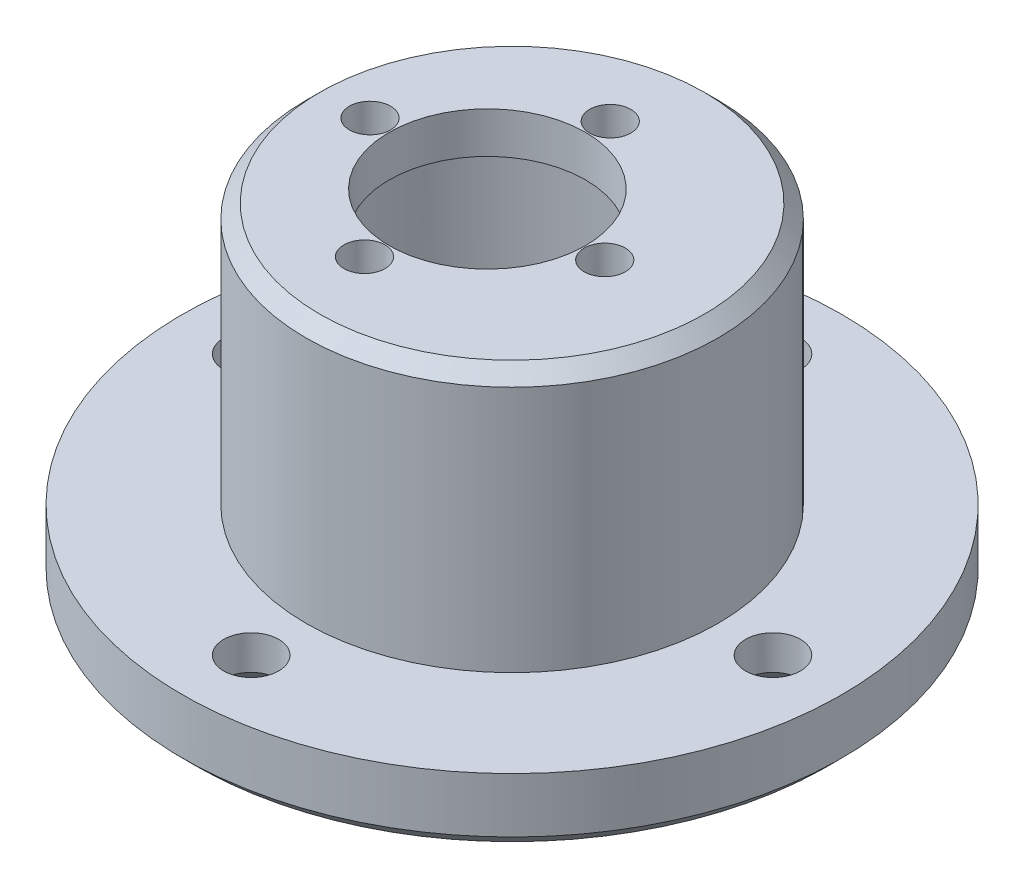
ISO-10303-21;
HEADER;
FILE_DESCRIPTION(('STEP AP214'),'2;1');
FILE_NAME('part.step','',(''),(''),'','','');
FILE_SCHEMA(('AUTOMOTIVE_DESIGN { 1 0 10303 214 1 1 1 1 }'));
ENDSEC;
DATA;
#1=APPLICATION_CONTEXT('core data for automotive mechanical design processes');
#2=APPLICATION_PROTOCOL_DEFINITION('international standard','automotive_design',2000,#1);
#3=PRODUCT_CONTEXT('',#1,'mechanical');
#4=PRODUCT('Part','Part','',(#3));
#5=PRODUCT_RELATED_PRODUCT_CATEGORY('part','',(#4));
#6=PRODUCT_DEFINITION_FORMATION('','',#4);
#7=PRODUCT_DEFINITION_CONTEXT('part definition',#1,'design');
#8=PRODUCT_DEFINITION('design','',#6,#7);
#9=PRODUCT_DEFINITION_SHAPE('','',#8);
#10=(LENGTH_UNIT() NAMED_UNIT(*) SI_UNIT(.MILLI.,.METRE.));
#11=(NAMED_UNIT(*) PLANE_ANGLE_UNIT() SI_UNIT($,.RADIAN.));
#12=(NAMED_UNIT(*) SI_UNIT($,.STERADIAN.) SOLID_ANGLE_UNIT());
#13=UNCERTAINTY_MEASURE_WITH_UNIT(LENGTH_MEASURE(1.E-05),#10,'distance_accuracy_value','');
#14=(GEOMETRIC_REPRESENTATION_CONTEXT(3) GLOBAL_UNCERTAINTY_ASSIGNED_CONTEXT((#13)) GLOBAL_UNIT_ASSIGNED_CONTEXT((#10,
#11,#12)) REPRESENTATION_CONTEXT('',''));
#15=CARTESIAN_POINT('',(0.,0.,0.));
#16=DIRECTION('',(0.,0.,1.));
#17=DIRECTION('',(1.,0.,0.));
#18=AXIS2_PLACEMENT_3D('',#15,#16,#17);
#19=CARTESIAN_POINT('',(0.,-5.,0.));
#20=DIRECTION('',(0.,-1.,0.));
#21=DIRECTION('',(0.,0.,-1.));
#22=AXIS2_PLACEMENT_3D('',#19,#20,#21);
#23=PLANE('',#22);
#24=CARTESIAN_POINT('',(-1.8,-5.,0.));
#25=DIRECTION('',(0.,-1.,0.));
#26=DIRECTION('',(0.,0.,-1.));
#27=AXIS2_PLACEMENT_3D('',#24,#25,#26);
#28=CIRCLE('',#27,12.75);
#29=CARTESIAN_POINT('',(-14.5369912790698,-5.,-0.575806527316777));
#30=VERTEX_POINT('',#29);
#31=CARTESIAN_POINT('',(-14.5369912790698,-5.,0.575806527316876));
#32=VERTEX_POINT('',#31);
#33=EDGE_CURVE('E47',#30,#32,#28,.T.);
#34=ORIENTED_EDGE('',*,*,#33,.F.);
#35=CARTESIAN_POINT('',(-19.,-5.,0.));
#36=DIRECTION('',(0.,-1.,0.));
#37=DIRECTION('',(-1.,0.,0.));
#38=AXIS2_PLACEMENT_3D('',#35,#36,#37);
#39=CIRCLE('',#38,4.5);
#40=CARTESIAN_POINT('',(-22.8881578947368,-5.,-2.26544216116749));
#41=VERTEX_POINT('',#40);
#42=EDGE_CURVE('E84',#30,#41,#39,.F.);
#43=ORIENTED_EDGE('',*,*,#42,.T.);
#44=CARTESIAN_POINT('',(0.,-5.,0.));
#45=DIRECTION('',(0.,-1.,0.));
#46=DIRECTION('',(0.,0.,-1.));
#47=AXIS2_PLACEMENT_3D('',#44,#45,#46);
#48=CIRCLE('',#47,23.);
#49=CARTESIAN_POINT('',(-2.26544216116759,-5.,-22.8881578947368));
#50=VERTEX_POINT('',#49);
#51=EDGE_CURVE('E119',#41,#50,#48,.T.);
#52=ORIENTED_EDGE('',*,*,#51,.T.);
#53=CARTESIAN_POINT('',(0.,-5.,-19.));
#54=DIRECTION('',(0.,-1.,0.));
#55=DIRECTION('',(0.,0.,-1.));
#56=AXIS2_PLACEMENT_3D('',#53,#54,#55);
#57=CIRCLE('',#56,4.5);
#58=CARTESIAN_POINT('',(2.26544216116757,-5.,-22.8881578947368));
#59=VERTEX_POINT('',#58);
#60=EDGE_CURVE('E130',#50,#59,#57,.F.);
#61=ORIENTED_EDGE('',*,*,#60,.T.);
#62=CARTESIAN_POINT('',(22.8881578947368,-5.,-2.26544216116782));
#63=VERTEX_POINT('',#62);
#64=EDGE_CURVE('E120',#59,#63,#48,.T.);
#65=ORIENTED_EDGE('',*,*,#64,.T.);
#66=CARTESIAN_POINT('',(19.,-5.,-1.99014436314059E-13));
#67=DIRECTION('',(0.,-1.,0.));
#68=DIRECTION('',(1.,0.,0.));
#69=AXIS2_PLACEMENT_3D('',#66,#67,#68);
#70=CIRCLE('',#69,4.5);
#71=CARTESIAN_POINT('',(22.8881578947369,-5.,2.26544216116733));
#72=VERTEX_POINT('',#71);
#73=EDGE_CURVE('E54',#63,#72,#70,.F.);
#74=ORIENTED_EDGE('',*,*,#73,.T.);
#75=CARTESIAN_POINT('',(2.26544216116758,-5.,22.8881578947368));
#76=VERTEX_POINT('',#75);
#77=EDGE_CURVE('E124',#72,#76,#48,.T.);
#78=ORIENTED_EDGE('',*,*,#77,.T.);
#79=CARTESIAN_POINT('',(0.,-5.,19.));
#80=DIRECTION('',(0.,-1.,0.));
#81=DIRECTION('',(0.,0.,1.));
#82=AXIS2_PLACEMENT_3D('',#79,#80,#81);
#83=CIRCLE('',#82,4.5);
#84=CARTESIAN_POINT('',(-2.26544216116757,-5.,22.8881578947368));
#85=VERTEX_POINT('',#84);
#86=EDGE_CURVE('E471',#76,#85,#83,.F.);
#87=ORIENTED_EDGE('',*,*,#86,.T.);
#88=CARTESIAN_POINT('',(-22.8881578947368,-5.,2.26544216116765));
#89=VERTEX_POINT('',#88);
#90=EDGE_CURVE('E476',#85,#89,#48,.T.);
#91=ORIENTED_EDGE('',*,*,#90,.T.);
#92=EDGE_CURVE('E86',#89,#32,#39,.F.);
#93=ORIENTED_EDGE('',*,*,#92,.T.);
#94=EDGE_LOOP('',(#34,#43,#52,#61,#65,#74,#78,#87,#91,#93));
#95=FACE_BOUND('',#94,.T.);
#96=ADVANCED_FACE('F31',(#95),#23,.T.);
#97=CARTESIAN_POINT('',(0.,-5.,0.));
#98=DIRECTION('',(0.,1.,0.));
#99=DIRECTION('',(0.,0.,1.));
#100=AXIS2_PLACEMENT_3D('',#97,#98,#99);
#101=CONICAL_SURFACE('',#100,23.,0.78539816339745);
#102=CARTESIAN_POINT('',(0.,-4.,0.));
#103=DIRECTION('',(0.,-1.,0.));
#104=DIRECTION('',(0.,0.,-1.));
#105=AXIS2_PLACEMENT_3D('',#102,#103,#104);
#106=CIRCLE('',#105,24.);
#107=CARTESIAN_POINT('',(0.,-4.,-24.));
#108=VERTEX_POINT('',#107);
#109=EDGE_CURVE('E123',#108,#108,#106,.F.);
#110=ORIENTED_EDGE('',*,*,#109,.F.);
#111=EDGE_LOOP('',(#110));
#112=FACE_BOUND('',#111,.T.);
#113=ORIENTED_EDGE('',*,*,#77,.F.);
#114=CARTESIAN_POINT('',(22.8881578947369,-5.,2.26544216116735));
#115=CARTESIAN_POINT('',(22.942196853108,-4.96266399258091,2.09865584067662));
#116=CARTESIAN_POINT('',(22.9907389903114,-4.92912578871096,1.9291749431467));
#117=CARTESIAN_POINT('',(23.0760448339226,-4.87018720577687,1.58577992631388));
#118=CARTESIAN_POINT('',(23.1128009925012,-4.84479204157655,1.41186304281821));
#119=CARTESIAN_POINT('',(23.1736453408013,-4.80275412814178,1.06096163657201));
#120=CARTESIAN_POINT('',(23.1977474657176,-4.78610175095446,0.883980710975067));
#121=CARTESIAN_POINT('',(23.2327932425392,-4.76188830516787,0.528151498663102));
#122=CARTESIAN_POINT('',(23.2437409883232,-4.75432440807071,0.349303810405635));
#123=CARTESIAN_POINT('',(23.2521348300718,-4.74852502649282,-0.0049821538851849));
#124=CARTESIAN_POINT('',(23.2498680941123,-4.75009113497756,-0.180410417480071));
#125=CARTESIAN_POINT('',(23.2325528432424,-4.76205439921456,-0.530333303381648));
#126=CARTESIAN_POINT('',(23.2175041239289,-4.77245169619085,-0.704827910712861));
#127=CARTESIAN_POINT('',(23.1750103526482,-4.80181102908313,-1.05121369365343));
#128=CARTESIAN_POINT('',(23.1475890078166,-4.82075668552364,-1.22310920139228));
#129=CARTESIAN_POINT('',(23.0809530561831,-4.8667960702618,-1.56340625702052));
#130=CARTESIAN_POINT('',(23.0417444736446,-4.89388563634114,-1.73180954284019));
#131=CARTESIAN_POINT('',(22.9803794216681,-4.93628330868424,-1.95989206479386));
#132=CARTESIAN_POINT('',(22.9629557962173,-4.94832144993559,-2.0215036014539));
#133=CARTESIAN_POINT('',(22.9266460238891,-4.97340820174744,-2.14400274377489));
#134=CARTESIAN_POINT('',(22.9077616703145,-4.9864555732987,-2.20489113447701));
#135=CARTESIAN_POINT('',(22.8881578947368,-5.,-2.26544216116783));
#136=B_SPLINE_CURVE_WITH_KNOTS('',3,(#114,#115,#116,#117,#118,#119,#120,#121,#122,#123,#124,
#125,#126,#127,#128,#129,#130,#131,#132,#133,#134,#135),.UNSPECIFIED.,.F.,.F.,(4,2,2,2,2,2,2,2,
2,2,4),(0.,0.53770654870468,1.07575676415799,1.61321320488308,2.1505023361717,2.67615961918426,
3.20182530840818,3.72648802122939,4.25088304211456,4.446311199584,4.64150313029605),.UNSPECIFIED.);
#137=EDGE_CURVE('E212',#72,#63,#136,.T.);
#138=ORIENTED_EDGE('',*,*,#137,.T.);
#139=ORIENTED_EDGE('',*,*,#64,.F.);
#140=CARTESIAN_POINT('',(2.26544216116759,-5.,-22.8881578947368));
#141=CARTESIAN_POINT('',(2.09865584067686,-4.96266399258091,-22.942196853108));
#142=CARTESIAN_POINT('',(1.92917494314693,-4.92912578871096,-22.9907389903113));
#143=CARTESIAN_POINT('',(1.58577992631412,-4.87018720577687,-23.0760448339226));
#144=CARTESIAN_POINT('',(1.41186304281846,-4.84479204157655,-23.1128009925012));
#145=CARTESIAN_POINT('',(1.06096163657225,-4.80275412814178,-23.1736453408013));
#146=CARTESIAN_POINT('',(0.88398071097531,-4.78610175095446,-23.1977474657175));
#147=CARTESIAN_POINT('',(0.528151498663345,-4.76188830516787,-23.2327932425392));
#148=CARTESIAN_POINT('',(0.349303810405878,-4.7543244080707,-23.2437409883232));
#149=CARTESIAN_POINT('',(-0.00498215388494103,-4.74852502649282,-23.2521348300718));
#150=CARTESIAN_POINT('',(-0.180410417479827,-4.75009113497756,-23.2498680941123));
#151=CARTESIAN_POINT('',(-0.530333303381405,-4.76205439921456,-23.2325528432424));
#152=CARTESIAN_POINT('',(-0.704827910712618,-4.77245169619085,-23.2175041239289));
#153=CARTESIAN_POINT('',(-1.05121369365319,-4.80181102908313,-23.1750103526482));
#154=CARTESIAN_POINT('',(-1.22310920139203,-4.82075668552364,-23.1475890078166));
#155=CARTESIAN_POINT('',(-1.56340625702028,-4.8667960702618,-23.0809530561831));
#156=CARTESIAN_POINT('',(-1.73180954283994,-4.89388563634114,-23.0417444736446));
#157=CARTESIAN_POINT('',(-1.95989206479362,-4.93628330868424,-22.9803794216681));
#158=CARTESIAN_POINT('',(-2.02150360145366,-4.94832144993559,-22.9629557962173));
#159=CARTESIAN_POINT('',(-2.14400274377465,-4.97340820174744,-22.9266460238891));
#160=CARTESIAN_POINT('',(-2.20489113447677,-4.9864555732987,-22.9077616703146));
#161=CARTESIAN_POINT('',(-2.26544216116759,-5.,-22.8881578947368));
#162=B_SPLINE_CURVE_WITH_KNOTS('',3,(#140,#141,#142,#143,#144,#145,#146,#147,#148,#149,#150,
#151,#152,#153,#154,#155,#156,#157,#158,#159,#160,#161),.UNSPECIFIED.,.F.,.F.,(4,2,2,2,2,2,2,2,
2,2,4),(0.,0.537706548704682,1.07575676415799,1.61321320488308,2.1505023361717,2.67615961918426,
3.20182530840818,3.72648802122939,4.25088304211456,4.446311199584,4.64150313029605),.UNSPECIFIED.);
#163=EDGE_CURVE('E41',#59,#50,#162,.T.);
#164=ORIENTED_EDGE('',*,*,#163,.T.);
#165=ORIENTED_EDGE('',*,*,#51,.F.);
#166=CARTESIAN_POINT('',(-22.8881578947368,-5.,-2.26544216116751));
#167=CARTESIAN_POINT('',(-22.942196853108,-4.96266399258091,-2.09865584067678));
#168=CARTESIAN_POINT('',(-22.9907389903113,-4.92912578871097,-1.92917494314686));
#169=CARTESIAN_POINT('',(-23.0760448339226,-4.87018720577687,-1.58577992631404));
#170=CARTESIAN_POINT('',(-23.1128009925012,-4.84479204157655,-1.41186304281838));
#171=CARTESIAN_POINT('',(-23.1736453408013,-4.80275412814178,-1.06096163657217));
#172=CARTESIAN_POINT('',(-23.1977474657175,-4.78610175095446,-0.883980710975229));
#173=CARTESIAN_POINT('',(-23.2327932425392,-4.76188830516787,-0.528151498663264));
#174=CARTESIAN_POINT('',(-23.2437409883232,-4.75432440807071,-0.349303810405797));
#175=CARTESIAN_POINT('',(-23.2521348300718,-4.74852502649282,0.00498215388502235));
#176=CARTESIAN_POINT('',(-23.2498680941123,-4.75009113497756,0.180410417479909));
#177=CARTESIAN_POINT('',(-23.2325528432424,-4.76205439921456,0.530333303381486));
#178=CARTESIAN_POINT('',(-23.2175041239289,-4.77245169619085,0.704827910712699));
#179=CARTESIAN_POINT('',(-23.1750103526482,-4.80181102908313,1.05121369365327));
#180=CARTESIAN_POINT('',(-23.1475890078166,-4.82075668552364,1.22310920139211));
#181=CARTESIAN_POINT('',(-23.0809530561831,-4.8667960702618,1.56340625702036));
#182=CARTESIAN_POINT('',(-23.0417444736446,-4.89388563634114,1.73180954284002));
#183=CARTESIAN_POINT('',(-22.9803794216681,-4.93628330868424,1.9598920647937));
#184=CARTESIAN_POINT('',(-22.9629557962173,-4.94832144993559,2.02150360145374));
#185=CARTESIAN_POINT('',(-22.9266460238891,-4.97340820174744,2.14400274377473));
#186=CARTESIAN_POINT('',(-22.9077616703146,-4.9864555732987,2.20489113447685));
#187=CARTESIAN_POINT('',(-22.8881578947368,-5.,2.26544216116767));
#188=B_SPLINE_CURVE_WITH_KNOTS('',3,(#166,#167,#168,#169,#170,#171,#172,#173,#174,#175,#176,
#177,#178,#179,#180,#181,#182,#183,#184,#185,#186,#187),.UNSPECIFIED.,.F.,.F.,(4,2,2,2,2,2,2,2,
2,2,4),(0.,0.537706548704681,1.07575676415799,1.61321320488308,2.1505023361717,2.67615961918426,
3.20182530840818,3.72648802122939,4.25088304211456,4.446311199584,4.64150313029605),.UNSPECIFIED.);
#189=EDGE_CURVE('E93',#41,#89,#188,.T.);
#190=ORIENTED_EDGE('',*,*,#189,.T.);
#191=ORIENTED_EDGE('',*,*,#90,.F.);
#192=CARTESIAN_POINT('',(-2.26544216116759,-5.,22.8881578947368));
#193=CARTESIAN_POINT('',(-2.09865584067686,-4.96266399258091,22.942196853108));
#194=CARTESIAN_POINT('',(-1.92917494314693,-4.92912578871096,22.9907389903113));
#195=CARTESIAN_POINT('',(-1.58577992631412,-4.87018720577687,23.0760448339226));
#196=CARTESIAN_POINT('',(-1.41186304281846,-4.84479204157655,23.1128009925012));
#197=CARTESIAN_POINT('',(-1.06096163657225,-4.80275412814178,23.1736453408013));
#198=CARTESIAN_POINT('',(-0.88398071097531,-4.78610175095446,23.1977474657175));
#199=CARTESIAN_POINT('',(-0.528151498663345,-4.76188830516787,23.2327932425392));
#200=CARTESIAN_POINT('',(-0.349303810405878,-4.7543244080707,23.2437409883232));
#201=CARTESIAN_POINT('',(0.00498215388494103,-4.74852502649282,23.2521348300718));
#202=CARTESIAN_POINT('',(0.180410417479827,-4.75009113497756,23.2498680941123));
#203=CARTESIAN_POINT('',(0.530333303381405,-4.76205439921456,23.2325528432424));
#204=CARTESIAN_POINT('',(0.704827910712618,-4.77245169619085,23.2175041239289));
#205=CARTESIAN_POINT('',(1.05121369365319,-4.80181102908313,23.1750103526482));
#206=CARTESIAN_POINT('',(1.22310920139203,-4.82075668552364,23.1475890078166));
#207=CARTESIAN_POINT('',(1.56340625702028,-4.8667960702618,23.0809530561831));
#208=CARTESIAN_POINT('',(1.73180954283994,-4.89388563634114,23.0417444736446));
#209=CARTESIAN_POINT('',(1.95989206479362,-4.93628330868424,22.9803794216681));
#210=CARTESIAN_POINT('',(2.02150360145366,-4.94832144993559,22.9629557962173));
#211=CARTESIAN_POINT('',(2.14400274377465,-4.97340820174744,22.9266460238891));
#212=CARTESIAN_POINT('',(2.20489113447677,-4.9864555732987,22.9077616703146));
#213=CARTESIAN_POINT('',(2.26544216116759,-5.,22.8881578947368));
#214=B_SPLINE_CURVE_WITH_KNOTS('',3,(#192,#193,#194,#195,#196,#197,#198,#199,#200,#201,#202,
#203,#204,#205,#206,#207,#208,#209,#210,#211,#212,#213),.UNSPECIFIED.,.F.,.F.,(4,2,2,2,2,2,2,2,
2,2,4),(0.,0.537706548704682,1.07575676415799,1.61321320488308,2.1505023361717,2.67615961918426,
3.20182530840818,3.72648802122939,4.25088304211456,4.446311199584,4.64150313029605),.UNSPECIFIED.);
#215=EDGE_CURVE('E192',#85,#76,#214,.T.);
#216=ORIENTED_EDGE('',*,*,#215,.T.);
#217=EDGE_LOOP('',(#113,#138,#139,#164,#165,#190,#191,#216));
#218=FACE_BOUND('',#217,.T.);
#219=ADVANCED_FACE('F143',(#112,#218),#101,.T.);
#220=CARTESIAN_POINT('',(0.,19.,0.));
#221=DIRECTION('',(0.,-1.,0.));
#222=DIRECTION('',(0.,0.,-1.));
#223=AXIS2_PLACEMENT_3D('',#220,#221,#222);
#224=CYLINDRICAL_SURFACE('',#223,15.);
#225=CARTESIAN_POINT('',(0.,18.,0.));
#226=DIRECTION('',(0.,1.,0.));
#227=DIRECTION('',(0.,0.,1.));
#228=AXIS2_PLACEMENT_3D('',#225,#226,#227);
#229=CIRCLE('',#228,15.);
#230=CARTESIAN_POINT('',(0.,18.,15.));
#231=VERTEX_POINT('',#230);
#232=EDGE_CURVE('E116',#231,#231,#229,.F.);
#233=ORIENTED_EDGE('',*,*,#232,.T.);
#234=EDGE_LOOP('',(#233));
#235=FACE_BOUND('',#234,.T.);
#236=CARTESIAN_POINT('',(0.,0.,0.));
#237=DIRECTION('',(0.,-1.,0.));
#238=DIRECTION('',(0.,0.,-1.));
#239=AXIS2_PLACEMENT_3D('',#236,#237,#238);
#240=CIRCLE('',#239,15.);
#241=CARTESIAN_POINT('',(0.,0.,-15.));
#242=VERTEX_POINT('',#241);
#243=EDGE_CURVE('E110',#242,#242,#240,.T.);
#244=ORIENTED_EDGE('',*,*,#243,.F.);
#245=EDGE_LOOP('',(#244));
#246=FACE_BOUND('',#245,.T.);
#247=ADVANCED_FACE('F147',(#235,#246),#224,.T.);
#248=CARTESIAN_POINT('',(0.,19.,0.));
#249=DIRECTION('',(0.,1.,0.));
#250=DIRECTION('',(0.,0.,1.));
#251=AXIS2_PLACEMENT_3D('',#248,#249,#250);
#252=PLANE('',#251);
#253=CARTESIAN_POINT('',(6.94771518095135,19.,0.199947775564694));
#254=DIRECTION('',(0.,1.,0.));
#255=DIRECTION('',(1.,0.,0.));
#256=AXIS2_PLACEMENT_3D('',#253,#254,#255);
#257=CIRCLE('',#256,1.5);
#258=CARTESIAN_POINT('',(8.44771518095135,19.,0.19994777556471));
#259=VERTEX_POINT('',#258);
#260=EDGE_CURVE('E255',#259,#259,#257,.T.);
#261=ORIENTED_EDGE('',*,*,#260,.F.);
#262=EDGE_LOOP('',(#261));
#263=FACE_BOUND('',#262,.T.);
#264=CARTESIAN_POINT('',(-1.6000522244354,19.,-8.74771518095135));
#265=DIRECTION('',(0.,1.,0.));
#266=DIRECTION('',(0.,0.,-1.));
#267=AXIS2_PLACEMENT_3D('',#264,#265,#266);
#268=CIRCLE('',#267,1.5);
#269=CARTESIAN_POINT('',(-1.6000522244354,19.,-10.2477151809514));
#270=VERTEX_POINT('',#269);
#271=EDGE_CURVE('E257',#270,#270,#268,.T.);
#272=ORIENTED_EDGE('',*,*,#271,.F.);
#273=EDGE_LOOP('',(#272));
#274=FACE_BOUND('',#273,.T.);
#275=CARTESIAN_POINT('',(-10.5477151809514,19.,-0.199947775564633));
#276=DIRECTION('',(0.,1.,0.));
#277=DIRECTION('',(-1.,0.,0.));
#278=AXIS2_PLACEMENT_3D('',#275,#276,#277);
#279=CIRCLE('',#278,1.5);
#280=CARTESIAN_POINT('',(-12.0477151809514,19.,-0.199947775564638));
#281=VERTEX_POINT('',#280);
#282=EDGE_CURVE('E262',#281,#281,#279,.T.);
#283=ORIENTED_EDGE('',*,*,#282,.F.);
#284=EDGE_LOOP('',(#283));
#285=FACE_BOUND('',#284,.T.);
#286=CARTESIAN_POINT('',(-1.9999477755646,19.,8.74771518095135));
#287=DIRECTION('',(0.,1.,0.));
#288=DIRECTION('',(0.,0.,1.));
#289=AXIS2_PLACEMENT_3D('',#286,#287,#288);
#290=CIRCLE('',#289,1.5);
#291=CARTESIAN_POINT('',(-1.9999477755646,19.,10.2477151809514));
#292=VERTEX_POINT('',#291);
#293=EDGE_CURVE('E266',#292,#292,#290,.T.);
#294=ORIENTED_EDGE('',*,*,#293,.F.);
#295=EDGE_LOOP('',(#294));
#296=FACE_BOUND('',#295,.T.);
#297=CARTESIAN_POINT('',(-1.8,19.,0.));
#298=DIRECTION('',(0.,-1.,0.));
#299=DIRECTION('',(0.,0.,-1.));
#300=AXIS2_PLACEMENT_3D('',#297,#298,#299);
#301=CIRCLE('',#300,7.15);
#302=CARTESIAN_POINT('',(-1.8,19.,-7.15));
#303=VERTEX_POINT('',#302);
#304=EDGE_CURVE('E88',#303,#303,#301,.T.);
#305=ORIENTED_EDGE('',*,*,#304,.T.);
#306=EDGE_LOOP('',(#305));
#307=FACE_BOUND('',#306,.T.);
#308=CARTESIAN_POINT('',(0.,19.,0.));
#309=DIRECTION('',(0.,1.,0.));
#310=DIRECTION('',(0.,0.,1.));
#311=AXIS2_PLACEMENT_3D('',#308,#309,#310);
#312=CIRCLE('',#311,14.);
#313=CARTESIAN_POINT('',(0.,19.,14.));
#314=VERTEX_POINT('',#313);
#315=EDGE_CURVE('E113',#314,#314,#312,.T.);
#316=ORIENTED_EDGE('',*,*,#315,.T.);
#317=EDGE_LOOP('',(#316));
#318=FACE_BOUND('',#317,.T.);
#319=ADVANCED_FACE('F157',(#263,#274,#285,#296,#307,#318),#252,.T.);
#320=CARTESIAN_POINT('',(0.,0.,0.));
#321=DIRECTION('',(0.,-1.,0.));
#322=DIRECTION('',(0.,0.,-1.));
#323=AXIS2_PLACEMENT_3D('',#320,#321,#322);
#324=PLANE('',#323);
#325=CARTESIAN_POINT('',(19.,0.,-1.99014436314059E-13));
#326=DIRECTION('',(0.,1.,0.));
#327=DIRECTION('',(-1.,0.,0.));
#328=AXIS2_PLACEMENT_3D('',#325,#326,#327);
#329=CIRCLE('',#328,2.);
#330=CARTESIAN_POINT('',(17.,0.,-1.78065548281E-13));
#331=VERTEX_POINT('',#330);
#332=EDGE_CURVE('E217',#331,#331,#329,.T.);
#333=ORIENTED_EDGE('',*,*,#332,.F.);
#334=EDGE_LOOP('',(#333));
#335=FACE_BOUND('',#334,.T.);
#336=CARTESIAN_POINT('',(0.,0.,19.));
#337=DIRECTION('',(0.,1.,0.));
#338=DIRECTION('',(0.,0.,-1.));
#339=AXIS2_PLACEMENT_3D('',#336,#337,#338);
#340=CIRCLE('',#339,2.);
#341=CARTESIAN_POINT('',(0.,0.,17.));
#342=VERTEX_POINT('',#341);
#343=EDGE_CURVE('E199',#342,#342,#340,.T.);
#344=ORIENTED_EDGE('',*,*,#343,.F.);
#345=EDGE_LOOP('',(#344));
#346=FACE_BOUND('',#345,.T.);
#347=CARTESIAN_POINT('',(-19.,0.,0.));
#348=DIRECTION('',(0.,1.,0.));
#349=DIRECTION('',(1.,0.,0.));
#350=AXIS2_PLACEMENT_3D('',#347,#348,#349);
#351=CIRCLE('',#350,2.);
#352=CARTESIAN_POINT('',(-17.,0.,0.));
#353=VERTEX_POINT('',#352);
#354=EDGE_CURVE('E95',#353,#353,#351,.T.);
#355=ORIENTED_EDGE('',*,*,#354,.F.);
#356=EDGE_LOOP('',(#355));
#357=FACE_BOUND('',#356,.T.);
#358=CARTESIAN_POINT('',(0.,0.,-19.));
#359=DIRECTION('',(0.,1.,0.));
#360=DIRECTION('',(0.,0.,1.));
#361=AXIS2_PLACEMENT_3D('',#358,#359,#360);
#362=CIRCLE('',#361,2.);
#363=CARTESIAN_POINT('',(0.,0.,-17.));
#364=VERTEX_POINT('',#363);
#365=EDGE_CURVE('E104',#364,#364,#362,.T.);
#366=ORIENTED_EDGE('',*,*,#365,.F.);
#367=EDGE_LOOP('',(#366));
#368=FACE_BOUND('',#367,.T.);
#369=CARTESIAN_POINT('',(0.,0.,0.));
#370=DIRECTION('',(0.,-1.,0.));
#371=DIRECTION('',(0.,0.,-1.));
#372=AXIS2_PLACEMENT_3D('',#369,#370,#371);
#373=CIRCLE('',#372,24.);
#374=CARTESIAN_POINT('',(0.,0.,-24.));
#375=VERTEX_POINT('',#374);
#376=EDGE_CURVE('E107',#375,#375,#373,.T.);
#377=ORIENTED_EDGE('',*,*,#376,.F.);
#378=EDGE_LOOP('',(#377));
#379=FACE_BOUND('',#378,.T.);
#380=ORIENTED_EDGE('',*,*,#243,.T.);
#381=EDGE_LOOP('',(#380));
#382=FACE_BOUND('',#381,.T.);
#383=ADVANCED_FACE('F161',(#335,#346,#357,#368,#379,#382),#324,.F.);
#384=CARTESIAN_POINT('',(0.,-5.,0.));
#385=DIRECTION('',(0.,1.,0.));
#386=DIRECTION('',(0.,0.,1.));
#387=AXIS2_PLACEMENT_3D('',#384,#385,#386);
#388=CYLINDRICAL_SURFACE('',#387,24.);
#389=ORIENTED_EDGE('',*,*,#109,.T.);
#390=EDGE_LOOP('',(#389));
#391=FACE_BOUND('',#390,.T.);
#392=ORIENTED_EDGE('',*,*,#376,.T.);
#393=EDGE_LOOP('',(#392));
#394=FACE_BOUND('',#393,.T.);
#395=ADVANCED_FACE('F153',(#391,#394),#388,.T.);
#396=CARTESIAN_POINT('',(0.,19.,0.));
#397=DIRECTION('',(0.,-1.,0.));
#398=DIRECTION('',(0.,0.,-1.));
#399=AXIS2_PLACEMENT_3D('',#396,#397,#398);
#400=CONICAL_SURFACE('',#399,14.,0.785398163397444);
#401=ORIENTED_EDGE('',*,*,#232,.F.);
#402=EDGE_LOOP('',(#401));
#403=FACE_BOUND('',#402,.T.);
#404=ORIENTED_EDGE('',*,*,#315,.F.);
#405=EDGE_LOOP('',(#404));
#406=FACE_BOUND('',#405,.T.);
#407=ADVANCED_FACE('F149',(#403,#406),#400,.T.);
#408=CARTESIAN_POINT('',(0.,-10.,-19.));
#409=DIRECTION('',(0.,1.,0.));
#410=DIRECTION('',(0.,0.,1.));
#411=AXIS2_PLACEMENT_3D('',#408,#409,#410);
#412=CYLINDRICAL_SURFACE('',#411,2.);
#413=CARTESIAN_POINT('',(0.,-2.50000000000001,-19.));
#414=DIRECTION('',(0.,-1.,0.));
#415=DIRECTION('',(0.,0.,-1.));
#416=AXIS2_PLACEMENT_3D('',#413,#414,#415);
#417=CIRCLE('',#416,2.);
#418=CARTESIAN_POINT('',(0.,-2.50000000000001,-21.));
#419=VERTEX_POINT('',#418);
#420=EDGE_CURVE('E127',#419,#419,#417,.T.);
#421=ORIENTED_EDGE('',*,*,#420,.T.);
#422=EDGE_LOOP('',(#421));
#423=FACE_BOUND('',#422,.T.);
#424=ORIENTED_EDGE('',*,*,#365,.T.);
#425=EDGE_LOOP('',(#424));
#426=FACE_BOUND('',#425,.T.);
#427=ADVANCED_FACE('F152',(#423,#426),#412,.F.);
#428=CARTESIAN_POINT('',(0.,-2.50000000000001,-19.));
#429=DIRECTION('',(0.,-1.,0.));
#430=DIRECTION('',(0.,0.,-1.));
#431=AXIS2_PLACEMENT_3D('',#428,#429,#430);
#432=CONICAL_SURFACE('',#431,2.,0.785398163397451);
#433=ORIENTED_EDGE('',*,*,#163,.F.);
#434=ORIENTED_EDGE('',*,*,#60,.F.);
#435=EDGE_LOOP('',(#433,#434));
#436=FACE_BOUND('',#435,.T.);
#437=ORIENTED_EDGE('',*,*,#420,.F.);
#438=EDGE_LOOP('',(#437));
#439=FACE_BOUND('',#438,.T.);
#440=ADVANCED_FACE('F33',(#436,#439),#432,.F.);
#441=CARTESIAN_POINT('',(-19.,-10.,0.));
#442=DIRECTION('',(0.,1.,0.));
#443=DIRECTION('',(1.,0.,0.));
#444=AXIS2_PLACEMENT_3D('',#441,#442,#443);
#445=CYLINDRICAL_SURFACE('',#444,2.);
#446=CARTESIAN_POINT('',(-19.,-2.50000000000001,0.));
#447=DIRECTION('',(0.,-1.,0.));
#448=DIRECTION('',(-1.,0.,0.));
#449=AXIS2_PLACEMENT_3D('',#446,#447,#448);
#450=CIRCLE('',#449,2.);
#451=CARTESIAN_POINT('',(-21.,-2.50000000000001,0.));
#452=VERTEX_POINT('',#451);
#453=EDGE_CURVE('E97',#452,#452,#450,.T.);
#454=ORIENTED_EDGE('',*,*,#453,.T.);
#455=EDGE_LOOP('',(#454));
#456=FACE_BOUND('',#455,.T.);
#457=ORIENTED_EDGE('',*,*,#354,.T.);
#458=EDGE_LOOP('',(#457));
#459=FACE_BOUND('',#458,.T.);
#460=ADVANCED_FACE('F176',(#456,#459),#445,.F.);
#461=CARTESIAN_POINT('',(-19.,-2.50000000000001,0.));
#462=DIRECTION('',(0.,-1.,0.));
#463=DIRECTION('',(-1.,0.,0.));
#464=AXIS2_PLACEMENT_3D('',#461,#462,#463);
#465=CONICAL_SURFACE('',#464,2.,0.785398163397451);
#466=CARTESIAN_POINT('',(-14.5369389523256,-5.0002,0.576962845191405));
#467=CARTESIAN_POINT('',(-14.5412768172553,-4.98359859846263,0.481445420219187));
#468=CARTESIAN_POINT('',(-14.5445509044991,-4.97101439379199,0.385154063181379));
#469=CARTESIAN_POINT('',(-14.5489038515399,-4.95424817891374,0.192571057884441));
#470=CARTESIAN_POINT('',(-14.55,-4.95,0.0962855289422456));
#471=CARTESIAN_POINT('',(-14.55,-4.95,-0.0962855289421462));
#472=CARTESIAN_POINT('',(-14.5489038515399,-4.95424817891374,-0.192571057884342));
#473=CARTESIAN_POINT('',(-14.5445509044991,-4.97101439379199,-0.385154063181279));
#474=CARTESIAN_POINT('',(-14.5412768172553,-4.98359859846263,-0.481445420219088));
#475=CARTESIAN_POINT('',(-14.5369389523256,-5.0002,-0.576962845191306));
#476=B_SPLINE_CURVE_WITH_KNOTS('',3,(#466,#467,#468,#469,#470,#471,#472,#473,#474,#475),
.UNSPECIFIED.,.F.,.F.,(4,2,2,2,4),(0.,0.291090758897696,0.57986143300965,0.868632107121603,
1.1597228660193),.UNSPECIFIED.);
#477=EDGE_CURVE('E11',#32,#30,#476,.T.);
#478=ORIENTED_EDGE('',*,*,#477,.F.);
#479=ORIENTED_EDGE('',*,*,#92,.F.);
#480=ORIENTED_EDGE('',*,*,#189,.F.);
#481=ORIENTED_EDGE('',*,*,#42,.F.);
#482=EDGE_LOOP('',(#478,#479,#480,#481));
#483=FACE_BOUND('',#482,.T.);
#484=ORIENTED_EDGE('',*,*,#453,.F.);
#485=EDGE_LOOP('',(#484));
#486=FACE_BOUND('',#485,.T.);
#487=ADVANCED_FACE('F90',(#483,#486),#465,.F.);
#488=CARTESIAN_POINT('',(0.,-10.,19.));
#489=DIRECTION('',(0.,1.,0.));
#490=DIRECTION('',(0.,0.,-1.));
#491=AXIS2_PLACEMENT_3D('',#488,#489,#490);
#492=CYLINDRICAL_SURFACE('',#491,2.);
#493=CARTESIAN_POINT('',(0.,-2.50000000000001,19.));
#494=DIRECTION('',(0.,-1.,0.));
#495=DIRECTION('',(0.,0.,1.));
#496=AXIS2_PLACEMENT_3D('',#493,#494,#495);
#497=CIRCLE('',#496,2.);
#498=CARTESIAN_POINT('',(0.,-2.50000000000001,21.));
#499=VERTEX_POINT('',#498);
#500=EDGE_CURVE('E181',#499,#499,#497,.T.);
#501=ORIENTED_EDGE('',*,*,#500,.T.);
#502=EDGE_LOOP('',(#501));
#503=FACE_BOUND('',#502,.T.);
#504=ORIENTED_EDGE('',*,*,#343,.T.);
#505=EDGE_LOOP('',(#504));
#506=FACE_BOUND('',#505,.T.);
#507=ADVANCED_FACE('F186',(#503,#506),#492,.F.);
#508=CARTESIAN_POINT('',(0.,-2.50000000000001,19.));
#509=DIRECTION('',(0.,-1.,0.));
#510=DIRECTION('',(0.,0.,1.));
#511=AXIS2_PLACEMENT_3D('',#508,#509,#510);
#512=CONICAL_SURFACE('',#511,2.,0.785398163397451);
#513=ORIENTED_EDGE('',*,*,#215,.F.);
#514=ORIENTED_EDGE('',*,*,#86,.F.);
#515=EDGE_LOOP('',(#513,#514));
#516=FACE_BOUND('',#515,.T.);
#517=ORIENTED_EDGE('',*,*,#500,.F.);
#518=EDGE_LOOP('',(#517));
#519=FACE_BOUND('',#518,.T.);
#520=ADVANCED_FACE('F202',(#516,#519),#512,.F.);
#521=CARTESIAN_POINT('',(19.,-10.,-1.99014436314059E-13));
#522=DIRECTION('',(0.,1.,0.));
#523=DIRECTION('',(-1.,0.,0.));
#524=AXIS2_PLACEMENT_3D('',#521,#522,#523);
#525=CYLINDRICAL_SURFACE('',#524,2.);
#526=CARTESIAN_POINT('',(19.,-2.50000000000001,-1.99014436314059E-13));
#527=DIRECTION('',(0.,-1.,0.));
#528=DIRECTION('',(1.,0.,0.));
#529=AXIS2_PLACEMENT_3D('',#526,#527,#528);
#530=CIRCLE('',#529,2.);
#531=CARTESIAN_POINT('',(21.,-2.50000000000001,-2.19963324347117E-13));
#532=VERTEX_POINT('',#531);
#533=EDGE_CURVE('E200',#532,#532,#530,.T.);
#534=ORIENTED_EDGE('',*,*,#533,.T.);
#535=EDGE_LOOP('',(#534));
#536=FACE_BOUND('',#535,.T.);
#537=ORIENTED_EDGE('',*,*,#332,.T.);
#538=EDGE_LOOP('',(#537));
#539=FACE_BOUND('',#538,.T.);
#540=ADVANCED_FACE('F206',(#536,#539),#525,.F.);
#541=CARTESIAN_POINT('',(19.,-2.50000000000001,-1.99014436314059E-13));
#542=DIRECTION('',(0.,-1.,0.));
#543=DIRECTION('',(1.,0.,0.));
#544=AXIS2_PLACEMENT_3D('',#541,#542,#543);
#545=CONICAL_SURFACE('',#544,2.,0.785398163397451);
#546=ORIENTED_EDGE('',*,*,#137,.F.);
#547=ORIENTED_EDGE('',*,*,#73,.F.);
#548=EDGE_LOOP('',(#546,#547));
#549=FACE_BOUND('',#548,.T.);
#550=ORIENTED_EDGE('',*,*,#533,.F.);
#551=EDGE_LOOP('',(#550));
#552=FACE_BOUND('',#551,.T.);
#553=ADVANCED_FACE('F219',(#549,#552),#545,.F.);
#554=CARTESIAN_POINT('',(-1.8,16.,0.));
#555=DIRECTION('',(0.,-1.,0.));
#556=DIRECTION('',(0.,0.,-1.));
#557=AXIS2_PLACEMENT_3D('',#554,#555,#556);
#558=CYLINDRICAL_SURFACE('',#557,12.75);
#559=ORIENTED_EDGE('',*,*,#477,.T.);
#560=ORIENTED_EDGE('',*,*,#33,.T.);
#561=EDGE_LOOP('',(#559,#560));
#562=FACE_BOUND('',#561,.T.);
#563=CARTESIAN_POINT('',(-1.8,16.,0.));
#564=DIRECTION('',(0.,-1.,0.));
#565=DIRECTION('',(0.,0.,-1.));
#566=AXIS2_PLACEMENT_3D('',#563,#564,#565);
#567=CIRCLE('',#566,12.75);
#568=CARTESIAN_POINT('',(-1.8,16.,-12.75));
#569=VERTEX_POINT('',#568);
#570=EDGE_CURVE('E87',#569,#569,#567,.T.);
#571=ORIENTED_EDGE('',*,*,#570,.F.);
#572=EDGE_LOOP('',(#571));
#573=FACE_BOUND('',#572,.T.);
#574=ADVANCED_FACE('F77',(#562,#573),#558,.F.);
#575=CARTESIAN_POINT('',(-1.8,16.,0.));
#576=DIRECTION('',(0.,-1.,0.));
#577=DIRECTION('',(0.,0.,-1.));
#578=AXIS2_PLACEMENT_3D('',#575,#576,#577);
#579=PLANE('',#578);
#580=CARTESIAN_POINT('',(6.94771518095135,16.,0.199947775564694));
#581=DIRECTION('',(0.,-1.,0.));
#582=DIRECTION('',(0.,0.,-1.));
#583=AXIS2_PLACEMENT_3D('',#580,#581,#582);
#584=CIRCLE('',#583,1.5);
#585=CARTESIAN_POINT('',(6.94771518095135,16.,-1.30005222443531));
#586=VERTEX_POINT('',#585);
#587=EDGE_CURVE('E36',#586,#586,#584,.T.);
#588=ORIENTED_EDGE('',*,*,#587,.F.);
#589=EDGE_LOOP('',(#588));
#590=FACE_BOUND('',#589,.T.);
#591=CARTESIAN_POINT('',(-1.6000522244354,16.,-8.74771518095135));
#592=DIRECTION('',(0.,-1.,0.));
#593=DIRECTION('',(0.,0.,-1.));
#594=AXIS2_PLACEMENT_3D('',#591,#592,#593);
#595=CIRCLE('',#594,1.5);
#596=CARTESIAN_POINT('',(-1.6000522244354,16.,-10.2477151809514));
#597=VERTEX_POINT('',#596);
#598=EDGE_CURVE('E261',#597,#597,#595,.T.);
#599=ORIENTED_EDGE('',*,*,#598,.F.);
#600=EDGE_LOOP('',(#599));
#601=FACE_BOUND('',#600,.T.);
#602=CARTESIAN_POINT('',(-10.5477151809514,16.,-0.199947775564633));
#603=DIRECTION('',(0.,-1.,0.));
#604=DIRECTION('',(0.,0.,-1.));
#605=AXIS2_PLACEMENT_3D('',#602,#603,#604);
#606=CIRCLE('',#605,1.5);
#607=CARTESIAN_POINT('',(-10.5477151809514,16.,-1.69994777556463));
#608=VERTEX_POINT('',#607);
#609=EDGE_CURVE('E265',#608,#608,#606,.T.);
#610=ORIENTED_EDGE('',*,*,#609,.F.);
#611=EDGE_LOOP('',(#610));
#612=FACE_BOUND('',#611,.T.);
#613=CARTESIAN_POINT('',(-1.9999477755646,16.,8.74771518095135));
#614=DIRECTION('',(0.,-1.,0.));
#615=DIRECTION('',(0.,0.,-1.));
#616=AXIS2_PLACEMENT_3D('',#613,#614,#615);
#617=CIRCLE('',#616,1.5);
#618=CARTESIAN_POINT('',(-1.9999477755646,16.,7.24771518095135));
#619=VERTEX_POINT('',#618);
#620=EDGE_CURVE('E269',#619,#619,#617,.T.);
#621=ORIENTED_EDGE('',*,*,#620,.F.);
#622=EDGE_LOOP('',(#621));
#623=FACE_BOUND('',#622,.T.);
#624=CARTESIAN_POINT('',(-1.8,16.,0.));
#625=DIRECTION('',(0.,-1.,0.));
#626=DIRECTION('',(0.,0.,-1.));
#627=AXIS2_PLACEMENT_3D('',#624,#625,#626);
#628=CIRCLE('',#627,7.15);
#629=CARTESIAN_POINT('',(-1.8,16.,-7.15));
#630=VERTEX_POINT('',#629);
#631=EDGE_CURVE('E272',#630,#630,#628,.T.);
#632=ORIENTED_EDGE('',*,*,#631,.F.);
#633=EDGE_LOOP('',(#632));
#634=FACE_BOUND('',#633,.T.);
#635=ORIENTED_EDGE('',*,*,#570,.T.);
#636=EDGE_LOOP('',(#635));
#637=FACE_BOUND('',#636,.T.);
#638=ADVANCED_FACE('F225',(#590,#601,#612,#623,#634,#637),#579,.T.);
#639=CARTESIAN_POINT('',(-1.8,19.,0.));
#640=DIRECTION('',(0.,-1.,0.));
#641=DIRECTION('',(0.,0.,-1.));
#642=AXIS2_PLACEMENT_3D('',#639,#640,#641);
#643=CYLINDRICAL_SURFACE('',#642,7.15);
#644=ORIENTED_EDGE('',*,*,#304,.F.);
#645=EDGE_LOOP('',(#644));
#646=FACE_BOUND('',#645,.T.);
#647=ORIENTED_EDGE('',*,*,#631,.T.);
#648=EDGE_LOOP('',(#647));
#649=FACE_BOUND('',#648,.T.);
#650=ADVANCED_FACE('F228',(#646,#649),#643,.F.);
#651=CARTESIAN_POINT('',(-1.9999477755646,-5.37686829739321,8.74771518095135));
#652=DIRECTION('',(0.,1.,0.));
#653=DIRECTION('',(0.,0.,1.));
#654=AXIS2_PLACEMENT_3D('',#651,#652,#653);
#655=CYLINDRICAL_SURFACE('',#654,1.5);
#656=ORIENTED_EDGE('',*,*,#620,.T.);
#657=EDGE_LOOP('',(#656));
#658=FACE_BOUND('',#657,.T.);
#659=ORIENTED_EDGE('',*,*,#293,.T.);
#660=EDGE_LOOP('',(#659));
#661=FACE_BOUND('',#660,.T.);
#662=ADVANCED_FACE('F232',(#658,#661),#655,.F.);
#663=CARTESIAN_POINT('',(-10.5477151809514,-5.37686829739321,-0.199947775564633));
#664=DIRECTION('',(0.,1.,0.));
#665=DIRECTION('',(0.,0.,1.));
#666=AXIS2_PLACEMENT_3D('',#663,#664,#665);
#667=CYLINDRICAL_SURFACE('',#666,1.5);
#668=ORIENTED_EDGE('',*,*,#609,.T.);
#669=EDGE_LOOP('',(#668));
#670=FACE_BOUND('',#669,.T.);
#671=ORIENTED_EDGE('',*,*,#282,.T.);
#672=EDGE_LOOP('',(#671));
#673=FACE_BOUND('',#672,.T.);
#674=ADVANCED_FACE('F236',(#670,#673),#667,.F.);
#675=CARTESIAN_POINT('',(-1.6000522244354,-5.37686829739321,-8.74771518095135));
#676=DIRECTION('',(0.,1.,0.));
#677=DIRECTION('',(0.,0.,1.));
#678=AXIS2_PLACEMENT_3D('',#675,#676,#677);
#679=CYLINDRICAL_SURFACE('',#678,1.5);
#680=ORIENTED_EDGE('',*,*,#598,.T.);
#681=EDGE_LOOP('',(#680));
#682=FACE_BOUND('',#681,.T.);
#683=ORIENTED_EDGE('',*,*,#271,.T.);
#684=EDGE_LOOP('',(#683));
#685=FACE_BOUND('',#684,.T.);
#686=ADVANCED_FACE('F240',(#682,#685),#679,.F.);
#687=CARTESIAN_POINT('',(6.94771518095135,-5.37686829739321,0.199947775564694));
#688=DIRECTION('',(0.,1.,0.));
#689=DIRECTION('',(0.,0.,1.));
#690=AXIS2_PLACEMENT_3D('',#687,#688,#689);
#691=CYLINDRICAL_SURFACE('',#690,1.5);
#692=ORIENTED_EDGE('',*,*,#587,.T.);
#693=EDGE_LOOP('',(#692));
#694=FACE_BOUND('',#693,.T.);
#695=ORIENTED_EDGE('',*,*,#260,.T.);
#696=EDGE_LOOP('',(#695));
#697=FACE_BOUND('',#696,.T.);
#698=ADVANCED_FACE('F244',(#694,#697),#691,.F.);
#699=CLOSED_SHELL('',(#96,#219,#247,#319,#383,#395,#407,#427,#440,#460,#487,#507,#520,#540,#553,
#574,#638,#650,#662,#674,#686,#698));
#700=MANIFOLD_SOLID_BREP('B2',#699);
#701=ADVANCED_BREP_SHAPE_REPRESENTATION('',(#18,#700),#14);
#702=SHAPE_DEFINITION_REPRESENTATION(#9,#701);
ENDSEC;
END-ISO-10303-21;
